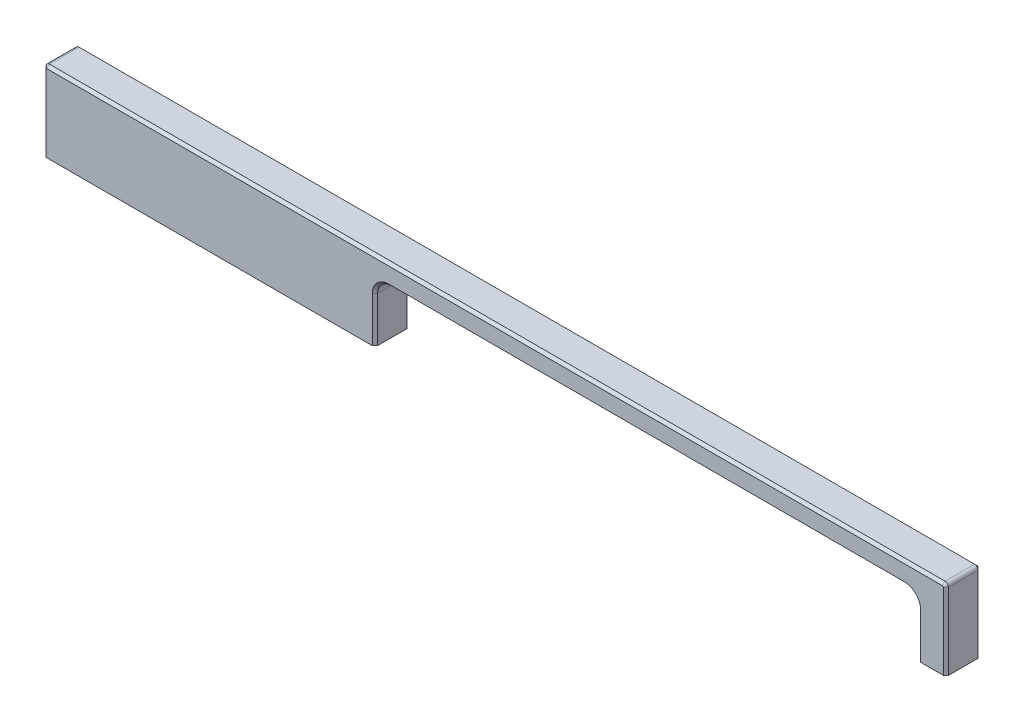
from build123d import *

# Parameters (mm, degrees)
EXTRUDE_1_DEPTH = 5
M4X0_7_1_D      = 3.3
M4X0_7_1_DEPTH  = 11.5
M4X0_7_1_TIP    = 0.991420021
FILLET_1_R      = 4
FILLET_2_R      = 1
CHAMFER_1_SIZE  = 0.75


with BuildPart() as part:
    # Sketch 1 → Extrude 1 (new, symmetric)
    with BuildSketch(Plane.XY):
        Polygon((130, 0), (122, 0), (122, 17), (-34.5, 17), (-34.5, 0), (-130, 0), (-130, 23), (130, 23), align=None)
    extrude(amount=EXTRUDE_1_DEPTH, both=True)

    # M4x0.7 _1
    with Locations(Plane(origin=(0, 0, 0), x_dir=(-1, 0, 0), z_dir=(0, -1, 0))):
        with Locations((-126, 0), (74, 0)):
            Hole(M4X0_7_1_D / 2, depth=M4X0_7_1_DEPTH)
            with Locations((0, 0, -(M4X0_7_1_DEPTH + M4X0_7_1_TIP / 2))):  # 118° drill point
                Cone(0, M4X0_7_1_D / 2, M4X0_7_1_TIP, mode=Mode.SUBTRACT)

    # Fillet 1
    fillet_1_edges = [part.edges().sort_by_distance(p)[0] for p in [
        (122, 17, 0),
        (-34.5, 17, 0),
    ]]
    fillet(fillet_1_edges, radius=FILLET_1_R)

    # Fillet 2
    fillet_2_edges = [part.edges().sort_by_distance(p)[0] for p in [
        (-130, 23, 0),
        (130, 23, 0),
    ]]
    fillet(fillet_2_edges, radius=FILLET_2_R)

    # Chamfer 1
    chamfer_1_edges = [part.edges().sort_by_distance(p)[0] for p in [
        (130, 11, -5),
        (-34.5, 6.5, 5),
        (122, 6.5, -5),
        (122, 6.5, 5),
        (43.75, 17, -5),
        (43.75, 17, 5),
        (120.828427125, 15.828427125, -5),
        (120.828427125, 15.828427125, 5),
        (-33.328427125, 15.828427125, -5),
        (-33.328427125, 15.828427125, 5),
        (0, 23, -5),
        (0, 23, 5),
        (-130, 11, -5),
        (-129.707106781, 22.707106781, -5),
        (129.707106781, 22.707106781, -5),
        (130, 11, 5),
        (-130, 11, 5),
        (-129.707106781, 22.707106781, 5),
        (129.707106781, 22.707106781, 5),
        (-34.5, 6.5, -5),
    ]]
    chamfer(chamfer_1_edges, length=CHAMFER_1_SIZE)


solid = part.part
